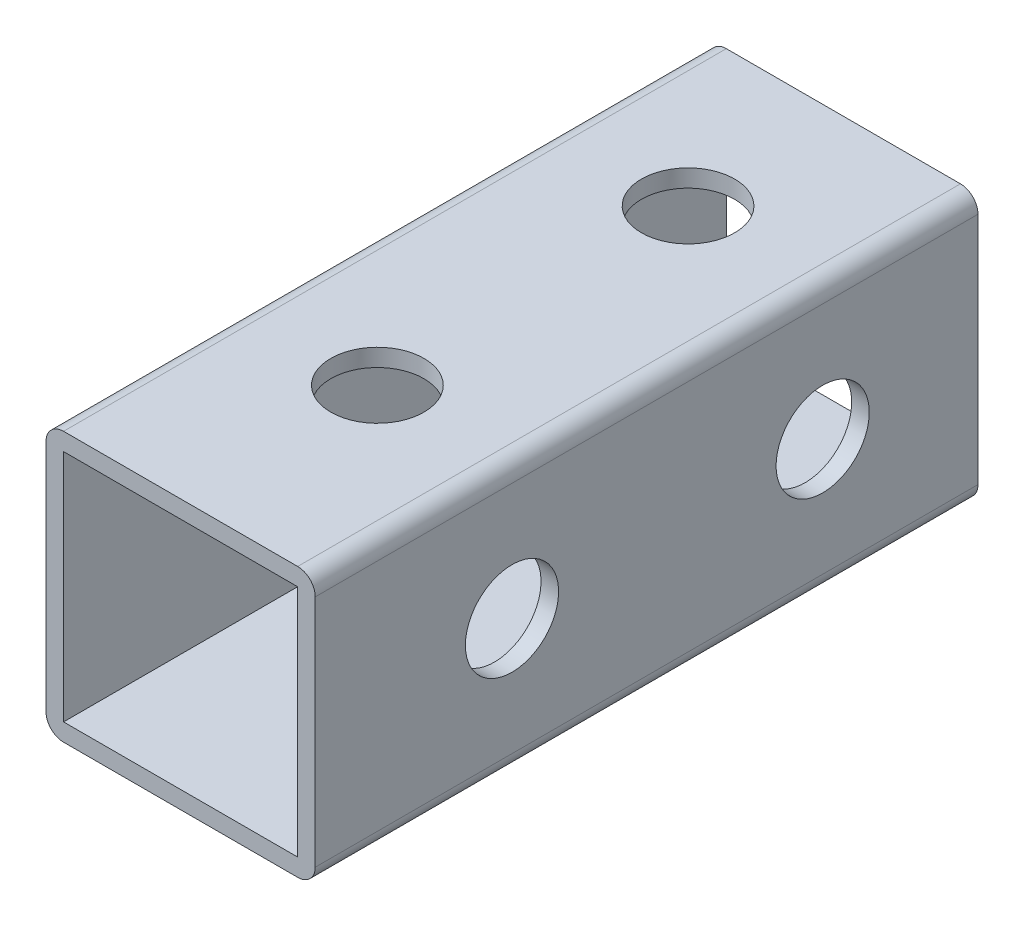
ISO-10303-21;
HEADER;
FILE_DESCRIPTION(('STEP AP214'),'2;1');
FILE_NAME('part.step','',(''),(''),'','','');
FILE_SCHEMA(('AUTOMOTIVE_DESIGN { 1 0 10303 214 1 1 1 1 }'));
ENDSEC;
DATA;
#1=APPLICATION_CONTEXT('core data for automotive mechanical design processes');
#2=APPLICATION_PROTOCOL_DEFINITION('international standard','automotive_design',2000,#1);
#3=PRODUCT_CONTEXT('',#1,'mechanical');
#4=PRODUCT('Part','Part','',(#3));
#5=PRODUCT_RELATED_PRODUCT_CATEGORY('part','',(#4));
#6=PRODUCT_DEFINITION_FORMATION('','',#4);
#7=PRODUCT_DEFINITION_CONTEXT('part definition',#1,'design');
#8=PRODUCT_DEFINITION('design','',#6,#7);
#9=PRODUCT_DEFINITION_SHAPE('','',#8);
#10=(LENGTH_UNIT() NAMED_UNIT(*) SI_UNIT(.MILLI.,.METRE.));
#11=(NAMED_UNIT(*) PLANE_ANGLE_UNIT() SI_UNIT($,.RADIAN.));
#12=(NAMED_UNIT(*) SI_UNIT($,.STERADIAN.) SOLID_ANGLE_UNIT());
#13=UNCERTAINTY_MEASURE_WITH_UNIT(LENGTH_MEASURE(1.E-05),#10,'distance_accuracy_value','');
#14=(GEOMETRIC_REPRESENTATION_CONTEXT(3) GLOBAL_UNCERTAINTY_ASSIGNED_CONTEXT((#13)) GLOBAL_UNIT_ASSIGNED_CONTEXT((#10,
#11,#12)) REPRESENTATION_CONTEXT('',''));
#15=CARTESIAN_POINT('',(0.,0.,0.));
#16=DIRECTION('',(0.,0.,1.));
#17=DIRECTION('',(1.,0.,0.));
#18=AXIS2_PLACEMENT_3D('',#15,#16,#17);
#19=CARTESIAN_POINT('',(17.9451,17.9451,101.6));
#20=DIRECTION('',(0.,0.,-1.));
#21=DIRECTION('',(-1.,0.,0.));
#22=AXIS2_PLACEMENT_3D('',#19,#20,#21);
#23=PLANE('',#22);
#24=CARTESIAN_POINT('',(17.9451,17.9451,101.6));
#25=DIRECTION('',(0.,0.,1.));
#26=DIRECTION('',(-1.,0.,0.));
#27=AXIS2_PLACEMENT_3D('',#24,#25,#26);
#28=CIRCLE('',#27,2.6924);
#29=CARTESIAN_POINT('',(20.6375,17.9451,101.6));
#30=VERTEX_POINT('',#29);
#31=CARTESIAN_POINT('',(17.9451,20.6375,101.6));
#32=VERTEX_POINT('',#31);
#33=EDGE_CURVE('E162',#30,#32,#28,.T.);
#34=ORIENTED_EDGE('',*,*,#33,.T.);
#35=DIRECTION('',(-1.,0.,0.));
#36=VECTOR('',#35,1.);
#37=CARTESIAN_POINT('',(-17.9451,20.6375,101.6));
#38=LINE('',#37,#36);
#39=CARTESIAN_POINT('',(-17.9451,20.6375,101.6));
#40=VERTEX_POINT('',#39);
#41=EDGE_CURVE('E165',#32,#40,#38,.T.);
#42=ORIENTED_EDGE('',*,*,#41,.T.);
#43=CARTESIAN_POINT('',(-17.9451,17.9451,101.6));
#44=DIRECTION('',(0.,0.,1.));
#45=DIRECTION('',(1.,0.,0.));
#46=AXIS2_PLACEMENT_3D('',#43,#44,#45);
#47=CIRCLE('',#46,2.6924);
#48=CARTESIAN_POINT('',(-20.6375,17.9451,101.6));
#49=VERTEX_POINT('',#48);
#50=EDGE_CURVE('E168',#40,#49,#47,.T.);
#51=ORIENTED_EDGE('',*,*,#50,.T.);
#52=DIRECTION('',(0.,-1.,0.));
#53=VECTOR('',#52,1.);
#54=CARTESIAN_POINT('',(-20.6375,17.9451,101.6));
#55=LINE('',#54,#53);
#56=CARTESIAN_POINT('',(-20.6375,-17.9451,101.6));
#57=VERTEX_POINT('',#56);
#58=EDGE_CURVE('E170',#49,#57,#55,.T.);
#59=ORIENTED_EDGE('',*,*,#58,.T.);
#60=CARTESIAN_POINT('',(-17.9451,-17.9451,101.6));
#61=DIRECTION('',(0.,0.,1.));
#62=DIRECTION('',(-1.,0.,0.));
#63=AXIS2_PLACEMENT_3D('',#60,#61,#62);
#64=CIRCLE('',#63,2.6924);
#65=CARTESIAN_POINT('',(-17.9451,-20.6375,101.6));
#66=VERTEX_POINT('',#65);
#67=EDGE_CURVE('E172',#57,#66,#64,.T.);
#68=ORIENTED_EDGE('',*,*,#67,.T.);
#69=DIRECTION('',(1.,0.,0.));
#70=VECTOR('',#69,1.);
#71=CARTESIAN_POINT('',(-17.9451,-20.6375,101.6));
#72=LINE('',#71,#70);
#73=CARTESIAN_POINT('',(17.9451,-20.6375,101.6));
#74=VERTEX_POINT('',#73);
#75=EDGE_CURVE('E174',#66,#74,#72,.T.);
#76=ORIENTED_EDGE('',*,*,#75,.T.);
#77=CARTESIAN_POINT('',(17.9451,-17.9451,101.6));
#78=DIRECTION('',(0.,0.,1.));
#79=DIRECTION('',(1.,0.,0.));
#80=AXIS2_PLACEMENT_3D('',#77,#78,#79);
#81=CIRCLE('',#80,2.6924);
#82=CARTESIAN_POINT('',(20.6375,-17.9451,101.6));
#83=VERTEX_POINT('',#82);
#84=EDGE_CURVE('E176',#74,#83,#81,.T.);
#85=ORIENTED_EDGE('',*,*,#84,.T.);
#86=DIRECTION('',(0.,1.,0.));
#87=VECTOR('',#86,1.);
#88=CARTESIAN_POINT('',(20.6375,-17.9451,101.6));
#89=LINE('',#88,#87);
#90=EDGE_CURVE('E178',#83,#30,#89,.T.);
#91=ORIENTED_EDGE('',*,*,#90,.T.);
#92=EDGE_LOOP('',(#34,#42,#51,#59,#68,#76,#85,#91));
#93=FACE_BOUND('',#92,.T.);
#94=DIRECTION('',(0.,1.,0.));
#95=VECTOR('',#94,1.);
#96=CARTESIAN_POINT('',(17.9451,-17.9451,101.6));
#97=LINE('',#96,#95);
#98=CARTESIAN_POINT('',(17.9451,-17.9451,101.6));
#99=VERTEX_POINT('',#98);
#100=CARTESIAN_POINT('',(17.9451,17.9451,101.6));
#101=VERTEX_POINT('',#100);
#102=EDGE_CURVE('E124',#99,#101,#97,.T.);
#103=ORIENTED_EDGE('',*,*,#102,.F.);
#104=DIRECTION('',(1.,0.,0.));
#105=VECTOR('',#104,1.);
#106=CARTESIAN_POINT('',(-17.9451,-17.9451,101.6));
#107=LINE('',#106,#105);
#108=CARTESIAN_POINT('',(-17.9451,-17.9451,101.6));
#109=VERTEX_POINT('',#108);
#110=EDGE_CURVE('E146',#109,#99,#107,.T.);
#111=ORIENTED_EDGE('',*,*,#110,.F.);
#112=DIRECTION('',(0.,-1.,0.));
#113=VECTOR('',#112,1.);
#114=CARTESIAN_POINT('',(-17.9451,17.9451,101.6));
#115=LINE('',#114,#113);
#116=CARTESIAN_POINT('',(-17.9451,17.9451,101.6));
#117=VERTEX_POINT('',#116);
#118=EDGE_CURVE('E144',#117,#109,#115,.T.);
#119=ORIENTED_EDGE('',*,*,#118,.F.);
#120=DIRECTION('',(-1.,0.,0.));
#121=VECTOR('',#120,1.);
#122=CARTESIAN_POINT('',(-17.9451,17.9451,101.6));
#123=LINE('',#122,#121);
#124=EDGE_CURVE('E132',#101,#117,#123,.T.);
#125=ORIENTED_EDGE('',*,*,#124,.F.);
#126=EDGE_LOOP('',(#103,#111,#119,#125));
#127=FACE_BOUND('',#126,.T.);
#128=ADVANCED_FACE('F33',(#93,#127),#23,.F.);
#129=CARTESIAN_POINT('',(17.9451,17.9451,0.));
#130=DIRECTION('',(0.,0.,-1.));
#131=DIRECTION('',(-1.,0.,0.));
#132=AXIS2_PLACEMENT_3D('',#129,#130,#131);
#133=PLANE('',#132);
#134=CARTESIAN_POINT('',(17.9451,17.9451,0.));
#135=DIRECTION('',(0.,0.,1.));
#136=DIRECTION('',(-1.,0.,0.));
#137=AXIS2_PLACEMENT_3D('',#134,#135,#136);
#138=CIRCLE('',#137,2.6924);
#139=CARTESIAN_POINT('',(20.6375,17.9451,0.));
#140=VERTEX_POINT('',#139);
#141=CARTESIAN_POINT('',(17.9451,20.6375,0.));
#142=VERTEX_POINT('',#141);
#143=EDGE_CURVE('E140',#140,#142,#138,.T.);
#144=ORIENTED_EDGE('',*,*,#143,.F.);
#145=DIRECTION('',(0.,1.,0.));
#146=VECTOR('',#145,1.);
#147=CARTESIAN_POINT('',(20.6375,-17.9451,0.));
#148=LINE('',#147,#146);
#149=CARTESIAN_POINT('',(20.6375,-17.9451,0.));
#150=VERTEX_POINT('',#149);
#151=EDGE_CURVE('E166',#150,#140,#148,.T.);
#152=ORIENTED_EDGE('',*,*,#151,.F.);
#153=CARTESIAN_POINT('',(17.9451,-17.9451,0.));
#154=DIRECTION('',(0.,0.,1.));
#155=DIRECTION('',(1.,0.,0.));
#156=AXIS2_PLACEMENT_3D('',#153,#154,#155);
#157=CIRCLE('',#156,2.6924);
#158=CARTESIAN_POINT('',(17.9451,-20.6375,0.));
#159=VERTEX_POINT('',#158);
#160=EDGE_CURVE('E193',#159,#150,#157,.T.);
#161=ORIENTED_EDGE('',*,*,#160,.F.);
#162=DIRECTION('',(1.,0.,0.));
#163=VECTOR('',#162,1.);
#164=CARTESIAN_POINT('',(-17.9451,-20.6375,0.));
#165=LINE('',#164,#163);
#166=CARTESIAN_POINT('',(-17.9451,-20.6375,0.));
#167=VERTEX_POINT('',#166);
#168=EDGE_CURVE('E191',#167,#159,#165,.T.);
#169=ORIENTED_EDGE('',*,*,#168,.F.);
#170=CARTESIAN_POINT('',(-17.9451,-17.9451,0.));
#171=DIRECTION('',(0.,0.,1.));
#172=DIRECTION('',(-1.,0.,0.));
#173=AXIS2_PLACEMENT_3D('',#170,#171,#172);
#174=CIRCLE('',#173,2.6924);
#175=CARTESIAN_POINT('',(-20.6375,-17.9451,0.));
#176=VERTEX_POINT('',#175);
#177=EDGE_CURVE('E189',#176,#167,#174,.T.);
#178=ORIENTED_EDGE('',*,*,#177,.F.);
#179=DIRECTION('',(0.,-1.,0.));
#180=VECTOR('',#179,1.);
#181=CARTESIAN_POINT('',(-20.6375,17.9451,0.));
#182=LINE('',#181,#180);
#183=CARTESIAN_POINT('',(-20.6375,17.9451,0.));
#184=VERTEX_POINT('',#183);
#185=EDGE_CURVE('E187',#184,#176,#182,.T.);
#186=ORIENTED_EDGE('',*,*,#185,.F.);
#187=CARTESIAN_POINT('',(-17.9451,17.9451,0.));
#188=DIRECTION('',(0.,0.,1.));
#189=DIRECTION('',(1.,0.,0.));
#190=AXIS2_PLACEMENT_3D('',#187,#188,#189);
#191=CIRCLE('',#190,2.6924);
#192=CARTESIAN_POINT('',(-17.9451,20.6375,0.));
#193=VERTEX_POINT('',#192);
#194=EDGE_CURVE('E185',#193,#184,#191,.T.);
#195=ORIENTED_EDGE('',*,*,#194,.F.);
#196=DIRECTION('',(-1.,0.,0.));
#197=VECTOR('',#196,1.);
#198=CARTESIAN_POINT('',(-17.9451,20.6375,0.));
#199=LINE('',#198,#197);
#200=EDGE_CURVE('E183',#142,#193,#199,.T.);
#201=ORIENTED_EDGE('',*,*,#200,.F.);
#202=EDGE_LOOP('',(#144,#152,#161,#169,#178,#186,#195,#201));
#203=FACE_BOUND('',#202,.T.);
#204=DIRECTION('',(1.,0.,0.));
#205=VECTOR('',#204,1.);
#206=CARTESIAN_POINT('',(-17.9451,-17.9451,0.));
#207=LINE('',#206,#205);
#208=CARTESIAN_POINT('',(-17.9451,-17.9451,0.));
#209=VERTEX_POINT('',#208);
#210=CARTESIAN_POINT('',(17.9451,-17.9451,0.));
#211=VERTEX_POINT('',#210);
#212=EDGE_CURVE('E133',#209,#211,#207,.T.);
#213=ORIENTED_EDGE('',*,*,#212,.T.);
#214=DIRECTION('',(0.,1.,0.));
#215=VECTOR('',#214,1.);
#216=CARTESIAN_POINT('',(17.9451,-17.9451,0.));
#217=LINE('',#216,#215);
#218=CARTESIAN_POINT('',(17.9451,17.9451,0.));
#219=VERTEX_POINT('',#218);
#220=EDGE_CURVE('E58',#211,#219,#217,.T.);
#221=ORIENTED_EDGE('',*,*,#220,.T.);
#222=DIRECTION('',(-1.,0.,0.));
#223=VECTOR('',#222,1.);
#224=CARTESIAN_POINT('',(-17.9451,17.9451,0.));
#225=LINE('',#224,#223);
#226=CARTESIAN_POINT('',(-17.9451,17.9451,0.));
#227=VERTEX_POINT('',#226);
#228=EDGE_CURVE('E139',#219,#227,#225,.T.);
#229=ORIENTED_EDGE('',*,*,#228,.T.);
#230=DIRECTION('',(0.,-1.,0.));
#231=VECTOR('',#230,1.);
#232=CARTESIAN_POINT('',(-17.9451,17.9451,0.));
#233=LINE('',#232,#231);
#234=EDGE_CURVE('E154',#227,#209,#233,.T.);
#235=ORIENTED_EDGE('',*,*,#234,.T.);
#236=EDGE_LOOP('',(#213,#221,#229,#235));
#237=FACE_BOUND('',#236,.T.);
#238=ADVANCED_FACE('F282',(#203,#237),#133,.T.);
#239=CARTESIAN_POINT('',(17.9451,17.9451,101.6));
#240=DIRECTION('',(0.,0.,-1.));
#241=DIRECTION('',(-1.,0.,0.));
#242=AXIS2_PLACEMENT_3D('',#239,#240,#241);
#243=CYLINDRICAL_SURFACE('',#242,2.6924);
#244=ORIENTED_EDGE('',*,*,#143,.T.);
#245=DIRECTION('',(0.,0.,-1.));
#246=VECTOR('',#245,1.);
#247=CARTESIAN_POINT('',(17.9451,20.6375,101.6));
#248=LINE('',#247,#246);
#249=EDGE_CURVE('E11',#32,#142,#248,.T.);
#250=ORIENTED_EDGE('',*,*,#249,.F.);
#251=ORIENTED_EDGE('',*,*,#33,.F.);
#252=DIRECTION('',(0.,0.,-1.));
#253=VECTOR('',#252,1.);
#254=CARTESIAN_POINT('',(20.6375,17.9451,101.6));
#255=LINE('',#254,#253);
#256=EDGE_CURVE('E180',#30,#140,#255,.T.);
#257=ORIENTED_EDGE('',*,*,#256,.T.);
#258=EDGE_LOOP('',(#244,#250,#251,#257));
#259=FACE_BOUND('',#258,.T.);
#260=ADVANCED_FACE('F35',(#259),#243,.T.);
#261=CARTESIAN_POINT('',(-17.9451,20.6375,101.6));
#262=DIRECTION('',(0.,-1.,0.));
#263=DIRECTION('',(0.,0.,-1.));
#264=AXIS2_PLACEMENT_3D('',#261,#262,#263);
#265=PLANE('',#264);
#266=CARTESIAN_POINT('',(0.,20.6375,71.4375));
#267=DIRECTION('',(0.,1.,0.));
#268=DIRECTION('',(0.,0.,1.));
#269=AXIS2_PLACEMENT_3D('',#266,#267,#268);
#270=CIRCLE('',#269,7.14375);
#271=CARTESIAN_POINT('',(0.,20.6375,78.58125));
#272=VERTEX_POINT('',#271);
#273=EDGE_CURVE('E234',#272,#272,#270,.T.);
#274=ORIENTED_EDGE('',*,*,#273,.F.);
#275=EDGE_LOOP('',(#274));
#276=FACE_BOUND('',#275,.T.);
#277=CARTESIAN_POINT('',(0.,20.6375,23.8125));
#278=DIRECTION('',(0.,1.,0.));
#279=DIRECTION('',(0.,0.,1.));
#280=AXIS2_PLACEMENT_3D('',#277,#278,#279);
#281=CIRCLE('',#280,7.14375);
#282=CARTESIAN_POINT('',(0.,20.6375,30.95625));
#283=VERTEX_POINT('',#282);
#284=EDGE_CURVE('E256',#283,#283,#281,.T.);
#285=ORIENTED_EDGE('',*,*,#284,.F.);
#286=EDGE_LOOP('',(#285));
#287=FACE_BOUND('',#286,.T.);
#288=ORIENTED_EDGE('',*,*,#200,.T.);
#289=DIRECTION('',(0.,0.,-1.));
#290=VECTOR('',#289,1.);
#291=CARTESIAN_POINT('',(-17.9451,20.6375,101.6));
#292=LINE('',#291,#290);
#293=EDGE_CURVE('E42',#40,#193,#292,.T.);
#294=ORIENTED_EDGE('',*,*,#293,.F.);
#295=ORIENTED_EDGE('',*,*,#41,.F.);
#296=ORIENTED_EDGE('',*,*,#249,.T.);
#297=EDGE_LOOP('',(#288,#294,#295,#296));
#298=FACE_BOUND('',#297,.T.);
#299=ADVANCED_FACE('F311',(#276,#287,#298),#265,.F.);
#300=CARTESIAN_POINT('',(-17.9451,17.9451,101.6));
#301=DIRECTION('',(0.,0.,-1.));
#302=DIRECTION('',(-1.,0.,0.));
#303=AXIS2_PLACEMENT_3D('',#300,#301,#302);
#304=CYLINDRICAL_SURFACE('',#303,2.6924);
#305=ORIENTED_EDGE('',*,*,#194,.T.);
#306=DIRECTION('',(0.,0.,-1.));
#307=VECTOR('',#306,1.);
#308=CARTESIAN_POINT('',(-20.6375,17.9451,101.6));
#309=LINE('',#308,#307);
#310=EDGE_CURVE('E210',#49,#184,#309,.T.);
#311=ORIENTED_EDGE('',*,*,#310,.F.);
#312=ORIENTED_EDGE('',*,*,#50,.F.);
#313=ORIENTED_EDGE('',*,*,#293,.T.);
#314=EDGE_LOOP('',(#305,#311,#312,#313));
#315=FACE_BOUND('',#314,.T.);
#316=ADVANCED_FACE('F308',(#315),#304,.T.);
#317=CARTESIAN_POINT('',(-20.6375,17.9451,101.6));
#318=DIRECTION('',(1.,0.,0.));
#319=DIRECTION('',(0.,0.,-1.));
#320=AXIS2_PLACEMENT_3D('',#317,#318,#319);
#321=PLANE('',#320);
#322=CARTESIAN_POINT('',(-20.6375,0.,71.4375));
#323=DIRECTION('',(-1.,0.,0.));
#324=DIRECTION('',(0.,0.,1.));
#325=AXIS2_PLACEMENT_3D('',#322,#323,#324);
#326=CIRCLE('',#325,7.14375);
#327=CARTESIAN_POINT('',(-20.6375,0.,78.58125));
#328=VERTEX_POINT('',#327);
#329=EDGE_CURVE('E236',#328,#328,#326,.T.);
#330=ORIENTED_EDGE('',*,*,#329,.F.);
#331=EDGE_LOOP('',(#330));
#332=FACE_BOUND('',#331,.T.);
#333=CARTESIAN_POINT('',(-20.6375,0.,23.8125));
#334=DIRECTION('',(-1.,0.,0.));
#335=DIRECTION('',(0.,0.,1.));
#336=AXIS2_PLACEMENT_3D('',#333,#334,#335);
#337=CIRCLE('',#336,7.14375);
#338=CARTESIAN_POINT('',(-20.6375,0.,30.95625));
#339=VERTEX_POINT('',#338);
#340=EDGE_CURVE('E249',#339,#339,#337,.T.);
#341=ORIENTED_EDGE('',*,*,#340,.F.);
#342=EDGE_LOOP('',(#341));
#343=FACE_BOUND('',#342,.T.);
#344=ORIENTED_EDGE('',*,*,#185,.T.);
#345=DIRECTION('',(0.,0.,-1.));
#346=VECTOR('',#345,1.);
#347=CARTESIAN_POINT('',(-20.6375,-17.9451,101.6));
#348=LINE('',#347,#346);
#349=EDGE_CURVE('E207',#57,#176,#348,.T.);
#350=ORIENTED_EDGE('',*,*,#349,.F.);
#351=ORIENTED_EDGE('',*,*,#58,.F.);
#352=ORIENTED_EDGE('',*,*,#310,.T.);
#353=EDGE_LOOP('',(#344,#350,#351,#352));
#354=FACE_BOUND('',#353,.T.);
#355=ADVANCED_FACE('F304',(#332,#343,#354),#321,.F.);
#356=CARTESIAN_POINT('',(-17.9451,-17.9451,101.6));
#357=DIRECTION('',(0.,0.,-1.));
#358=DIRECTION('',(-1.,0.,0.));
#359=AXIS2_PLACEMENT_3D('',#356,#357,#358);
#360=CYLINDRICAL_SURFACE('',#359,2.6924);
#361=ORIENTED_EDGE('',*,*,#177,.T.);
#362=DIRECTION('',(0.,0.,-1.));
#363=VECTOR('',#362,1.);
#364=CARTESIAN_POINT('',(-17.9451,-20.6375,101.6));
#365=LINE('',#364,#363);
#366=EDGE_CURVE('E204',#66,#167,#365,.T.);
#367=ORIENTED_EDGE('',*,*,#366,.F.);
#368=ORIENTED_EDGE('',*,*,#67,.F.);
#369=ORIENTED_EDGE('',*,*,#349,.T.);
#370=EDGE_LOOP('',(#361,#367,#368,#369));
#371=FACE_BOUND('',#370,.T.);
#372=ADVANCED_FACE('F300',(#371),#360,.T.);
#373=CARTESIAN_POINT('',(-17.9451,-20.6375,101.6));
#374=DIRECTION('',(0.,1.,0.));
#375=DIRECTION('',(0.,0.,1.));
#376=AXIS2_PLACEMENT_3D('',#373,#374,#375);
#377=PLANE('',#376);
#378=CARTESIAN_POINT('',(0.,-20.6375,71.4375));
#379=DIRECTION('',(0.,1.,0.));
#380=DIRECTION('',(0.,0.,1.));
#381=AXIS2_PLACEMENT_3D('',#378,#379,#380);
#382=CIRCLE('',#381,7.14375);
#383=CARTESIAN_POINT('',(0.,-20.6375,78.58125));
#384=VERTEX_POINT('',#383);
#385=EDGE_CURVE('E227',#384,#384,#382,.T.);
#386=ORIENTED_EDGE('',*,*,#385,.T.);
#387=EDGE_LOOP('',(#386));
#388=FACE_BOUND('',#387,.T.);
#389=CARTESIAN_POINT('',(0.,-20.6375,23.8125));
#390=DIRECTION('',(0.,1.,0.));
#391=DIRECTION('',(0.,0.,1.));
#392=AXIS2_PLACEMENT_3D('',#389,#390,#391);
#393=CIRCLE('',#392,7.14375);
#394=CARTESIAN_POINT('',(0.,-20.6375,30.95625));
#395=VERTEX_POINT('',#394);
#396=EDGE_CURVE('E218',#395,#395,#393,.T.);
#397=ORIENTED_EDGE('',*,*,#396,.T.);
#398=EDGE_LOOP('',(#397));
#399=FACE_BOUND('',#398,.T.);
#400=ORIENTED_EDGE('',*,*,#168,.T.);
#401=DIRECTION('',(0.,0.,-1.));
#402=VECTOR('',#401,1.);
#403=CARTESIAN_POINT('',(17.9451,-20.6375,101.6));
#404=LINE('',#403,#402);
#405=EDGE_CURVE('E201',#74,#159,#404,.T.);
#406=ORIENTED_EDGE('',*,*,#405,.F.);
#407=ORIENTED_EDGE('',*,*,#75,.F.);
#408=ORIENTED_EDGE('',*,*,#366,.T.);
#409=EDGE_LOOP('',(#400,#406,#407,#408));
#410=FACE_BOUND('',#409,.T.);
#411=ADVANCED_FACE('F296',(#388,#399,#410),#377,.F.);
#412=CARTESIAN_POINT('',(17.9451,-17.9451,101.6));
#413=DIRECTION('',(0.,0.,-1.));
#414=DIRECTION('',(-1.,0.,0.));
#415=AXIS2_PLACEMENT_3D('',#412,#413,#414);
#416=CYLINDRICAL_SURFACE('',#415,2.6924);
#417=ORIENTED_EDGE('',*,*,#160,.T.);
#418=DIRECTION('',(0.,0.,-1.));
#419=VECTOR('',#418,1.);
#420=CARTESIAN_POINT('',(20.6375,-17.9451,101.6));
#421=LINE('',#420,#419);
#422=EDGE_CURVE('E198',#83,#150,#421,.T.);
#423=ORIENTED_EDGE('',*,*,#422,.F.);
#424=ORIENTED_EDGE('',*,*,#84,.F.);
#425=ORIENTED_EDGE('',*,*,#405,.T.);
#426=EDGE_LOOP('',(#417,#423,#424,#425));
#427=FACE_BOUND('',#426,.T.);
#428=ADVANCED_FACE('F293',(#427),#416,.T.);
#429=CARTESIAN_POINT('',(20.6375,-17.9451,101.6));
#430=DIRECTION('',(-1.,0.,0.));
#431=DIRECTION('',(0.,0.,1.));
#432=AXIS2_PLACEMENT_3D('',#429,#430,#431);
#433=PLANE('',#432);
#434=CARTESIAN_POINT('',(20.6375000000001,0.,71.4375));
#435=DIRECTION('',(-1.,0.,0.));
#436=DIRECTION('',(0.,0.,1.));
#437=AXIS2_PLACEMENT_3D('',#434,#435,#436);
#438=CIRCLE('',#437,7.14375);
#439=CARTESIAN_POINT('',(20.6375000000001,0.,78.58125));
#440=VERTEX_POINT('',#439);
#441=EDGE_CURVE('E230',#440,#440,#438,.T.);
#442=ORIENTED_EDGE('',*,*,#441,.T.);
#443=EDGE_LOOP('',(#442));
#444=FACE_BOUND('',#443,.T.);
#445=CARTESIAN_POINT('',(20.6375000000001,0.,23.8125));
#446=DIRECTION('',(-1.,0.,0.));
#447=DIRECTION('',(0.,0.,1.));
#448=AXIS2_PLACEMENT_3D('',#445,#446,#447);
#449=CIRCLE('',#448,7.14375);
#450=CARTESIAN_POINT('',(20.6375000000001,0.,30.95625));
#451=VERTEX_POINT('',#450);
#452=EDGE_CURVE('E223',#451,#451,#449,.T.);
#453=ORIENTED_EDGE('',*,*,#452,.T.);
#454=EDGE_LOOP('',(#453));
#455=FACE_BOUND('',#454,.T.);
#456=ORIENTED_EDGE('',*,*,#151,.T.);
#457=ORIENTED_EDGE('',*,*,#256,.F.);
#458=ORIENTED_EDGE('',*,*,#90,.F.);
#459=ORIENTED_EDGE('',*,*,#422,.T.);
#460=EDGE_LOOP('',(#456,#457,#458,#459));
#461=FACE_BOUND('',#460,.T.);
#462=ADVANCED_FACE('F277',(#444,#455,#461),#433,.F.);
#463=CARTESIAN_POINT('',(17.9451,-17.9451,101.6));
#464=DIRECTION('',(-1.,0.,0.));
#465=DIRECTION('',(0.,0.,1.));
#466=AXIS2_PLACEMENT_3D('',#463,#464,#465);
#467=PLANE('',#466);
#468=CARTESIAN_POINT('',(17.9451,0.,71.4375));
#469=DIRECTION('',(-1.,0.,0.));
#470=DIRECTION('',(0.,0.,1.));
#471=AXIS2_PLACEMENT_3D('',#468,#469,#470);
#472=CIRCLE('',#471,7.14375);
#473=CARTESIAN_POINT('',(17.9451,0.,78.58125));
#474=VERTEX_POINT('',#473);
#475=EDGE_CURVE('E37',#474,#474,#472,.T.);
#476=ORIENTED_EDGE('',*,*,#475,.F.);
#477=EDGE_LOOP('',(#476));
#478=FACE_BOUND('',#477,.T.);
#479=CARTESIAN_POINT('',(17.9451,0.,23.8125));
#480=DIRECTION('',(-1.,0.,0.));
#481=DIRECTION('',(0.,0.,1.));
#482=AXIS2_PLACEMENT_3D('',#479,#480,#481);
#483=CIRCLE('',#482,7.14375);
#484=CARTESIAN_POINT('',(17.9451,0.,30.95625));
#485=VERTEX_POINT('',#484);
#486=EDGE_CURVE('E222',#485,#485,#483,.T.);
#487=ORIENTED_EDGE('',*,*,#486,.F.);
#488=EDGE_LOOP('',(#487));
#489=FACE_BOUND('',#488,.T.);
#490=ORIENTED_EDGE('',*,*,#220,.F.);
#491=DIRECTION('',(0.,0.,-1.));
#492=VECTOR('',#491,1.);
#493=CARTESIAN_POINT('',(17.9451,-17.9451,101.6));
#494=LINE('',#493,#492);
#495=EDGE_CURVE('E128',#99,#211,#494,.T.);
#496=ORIENTED_EDGE('',*,*,#495,.F.);
#497=ORIENTED_EDGE('',*,*,#102,.T.);
#498=DIRECTION('',(0.,0.,-1.));
#499=VECTOR('',#498,1.);
#500=CARTESIAN_POINT('',(17.9451,17.9451,101.6));
#501=LINE('',#500,#499);
#502=EDGE_CURVE('E127',#101,#219,#501,.T.);
#503=ORIENTED_EDGE('',*,*,#502,.T.);
#504=EDGE_LOOP('',(#490,#496,#497,#503));
#505=FACE_BOUND('',#504,.T.);
#506=ADVANCED_FACE('F126',(#478,#489,#505),#467,.T.);
#507=CARTESIAN_POINT('',(-17.9451,17.9451,101.6));
#508=DIRECTION('',(0.,-1.,0.));
#509=DIRECTION('',(0.,0.,-1.));
#510=AXIS2_PLACEMENT_3D('',#507,#508,#509);
#511=PLANE('',#510);
#512=CARTESIAN_POINT('',(0.,17.9451,71.4375));
#513=DIRECTION('',(0.,-1.,0.));
#514=DIRECTION('',(0.,0.,-1.));
#515=AXIS2_PLACEMENT_3D('',#512,#513,#514);
#516=CIRCLE('',#515,7.14375);
#517=CARTESIAN_POINT('',(0.,17.9451,64.29375));
#518=VERTEX_POINT('',#517);
#519=EDGE_CURVE('E226',#518,#518,#516,.T.);
#520=ORIENTED_EDGE('',*,*,#519,.F.);
#521=EDGE_LOOP('',(#520));
#522=FACE_BOUND('',#521,.T.);
#523=CARTESIAN_POINT('',(0.,17.9451,23.8125));
#524=DIRECTION('',(0.,-1.,0.));
#525=DIRECTION('',(0.,0.,-1.));
#526=AXIS2_PLACEMENT_3D('',#523,#524,#525);
#527=CIRCLE('',#526,7.14375);
#528=CARTESIAN_POINT('',(0.,17.9451,16.66875));
#529=VERTEX_POINT('',#528);
#530=EDGE_CURVE('E152',#529,#529,#527,.T.);
#531=ORIENTED_EDGE('',*,*,#530,.F.);
#532=EDGE_LOOP('',(#531));
#533=FACE_BOUND('',#532,.T.);
#534=ORIENTED_EDGE('',*,*,#228,.F.);
#535=ORIENTED_EDGE('',*,*,#502,.F.);
#536=ORIENTED_EDGE('',*,*,#124,.T.);
#537=DIRECTION('',(0.,0.,-1.));
#538=VECTOR('',#537,1.);
#539=CARTESIAN_POINT('',(-17.9451,17.9451,101.6));
#540=LINE('',#539,#538);
#541=EDGE_CURVE('E141',#117,#227,#540,.T.);
#542=ORIENTED_EDGE('',*,*,#541,.T.);
#543=EDGE_LOOP('',(#534,#535,#536,#542));
#544=FACE_BOUND('',#543,.T.);
#545=ADVANCED_FACE('F136',(#522,#533,#544),#511,.T.);
#546=CARTESIAN_POINT('',(-17.9451,17.9451,101.6));
#547=DIRECTION('',(1.,0.,0.));
#548=DIRECTION('',(0.,0.,-1.));
#549=AXIS2_PLACEMENT_3D('',#546,#547,#548);
#550=PLANE('',#549);
#551=CARTESIAN_POINT('',(-17.9451,0.,71.4375));
#552=DIRECTION('',(1.,0.,0.));
#553=DIRECTION('',(0.,0.,-1.));
#554=AXIS2_PLACEMENT_3D('',#551,#552,#553);
#555=CIRCLE('',#554,7.14375);
#556=CARTESIAN_POINT('',(-17.9451,0.,64.29375));
#557=VERTEX_POINT('',#556);
#558=EDGE_CURVE('E228',#557,#557,#555,.T.);
#559=ORIENTED_EDGE('',*,*,#558,.F.);
#560=EDGE_LOOP('',(#559));
#561=FACE_BOUND('',#560,.T.);
#562=CARTESIAN_POINT('',(-17.9451,0.,23.8125));
#563=DIRECTION('',(1.,0.,0.));
#564=DIRECTION('',(0.,0.,-1.));
#565=AXIS2_PLACEMENT_3D('',#562,#563,#564);
#566=CIRCLE('',#565,7.14375);
#567=CARTESIAN_POINT('',(-17.9451,0.,16.66875));
#568=VERTEX_POINT('',#567);
#569=EDGE_CURVE('E219',#568,#568,#566,.T.);
#570=ORIENTED_EDGE('',*,*,#569,.F.);
#571=EDGE_LOOP('',(#570));
#572=FACE_BOUND('',#571,.T.);
#573=ORIENTED_EDGE('',*,*,#234,.F.);
#574=ORIENTED_EDGE('',*,*,#541,.F.);
#575=ORIENTED_EDGE('',*,*,#118,.T.);
#576=DIRECTION('',(0.,0.,-1.));
#577=VECTOR('',#576,1.);
#578=CARTESIAN_POINT('',(-17.9451,-17.9451,101.6));
#579=LINE('',#578,#577);
#580=EDGE_CURVE('E50',#109,#209,#579,.T.);
#581=ORIENTED_EDGE('',*,*,#580,.T.);
#582=EDGE_LOOP('',(#573,#574,#575,#581));
#583=FACE_BOUND('',#582,.T.);
#584=ADVANCED_FACE('F267',(#561,#572,#583),#550,.T.);
#585=CARTESIAN_POINT('',(-17.9451,-17.9451,101.6));
#586=DIRECTION('',(0.,1.,0.));
#587=DIRECTION('',(0.,0.,1.));
#588=AXIS2_PLACEMENT_3D('',#585,#586,#587);
#589=PLANE('',#588);
#590=CARTESIAN_POINT('',(0.,-17.9451,71.4375));
#591=DIRECTION('',(0.,1.,0.));
#592=DIRECTION('',(0.,0.,1.));
#593=AXIS2_PLACEMENT_3D('',#590,#591,#592);
#594=CIRCLE('',#593,7.14375);
#595=CARTESIAN_POINT('',(0.,-17.9451,78.58125));
#596=VERTEX_POINT('',#595);
#597=EDGE_CURVE('E224',#596,#596,#594,.T.);
#598=ORIENTED_EDGE('',*,*,#597,.F.);
#599=EDGE_LOOP('',(#598));
#600=FACE_BOUND('',#599,.T.);
#601=CARTESIAN_POINT('',(0.,-17.9451,23.8125));
#602=DIRECTION('',(0.,1.,0.));
#603=DIRECTION('',(0.,0.,1.));
#604=AXIS2_PLACEMENT_3D('',#601,#602,#603);
#605=CIRCLE('',#604,7.14375);
#606=CARTESIAN_POINT('',(0.,-17.9451,30.95625));
#607=VERTEX_POINT('',#606);
#608=EDGE_CURVE('E215',#607,#607,#605,.T.);
#609=ORIENTED_EDGE('',*,*,#608,.F.);
#610=EDGE_LOOP('',(#609));
#611=FACE_BOUND('',#610,.T.);
#612=ORIENTED_EDGE('',*,*,#212,.F.);
#613=ORIENTED_EDGE('',*,*,#580,.F.);
#614=ORIENTED_EDGE('',*,*,#110,.T.);
#615=ORIENTED_EDGE('',*,*,#495,.T.);
#616=EDGE_LOOP('',(#612,#613,#614,#615));
#617=FACE_BOUND('',#616,.T.);
#618=ADVANCED_FACE('F274',(#600,#611,#617),#589,.T.);
#619=CARTESIAN_POINT('',(0.,-20.6375,23.8125));
#620=DIRECTION('',(0.,1.,0.));
#621=DIRECTION('',(0.,0.,1.));
#622=AXIS2_PLACEMENT_3D('',#619,#620,#621);
#623=CYLINDRICAL_SURFACE('',#622,7.14375);
#624=ORIENTED_EDGE('',*,*,#608,.T.);
#625=EDGE_LOOP('',(#624));
#626=FACE_BOUND('',#625,.T.);
#627=ORIENTED_EDGE('',*,*,#396,.F.);
#628=EDGE_LOOP('',(#627));
#629=FACE_BOUND('',#628,.T.);
#630=ADVANCED_FACE('F351',(#626,#629),#623,.F.);
#631=ORIENTED_EDGE('',*,*,#530,.T.);
#632=EDGE_LOOP('',(#631));
#633=FACE_BOUND('',#632,.T.);
#634=ORIENTED_EDGE('',*,*,#284,.T.);
#635=EDGE_LOOP('',(#634));
#636=FACE_BOUND('',#635,.T.);
#637=ADVANCED_FACE('F263',(#633,#636),#623,.F.);
#638=CARTESIAN_POINT('',(20.6375000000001,0.,23.8125));
#639=DIRECTION('',(-1.,0.,0.));
#640=DIRECTION('',(0.,-1.,0.));
#641=AXIS2_PLACEMENT_3D('',#638,#639,#640);
#642=CYLINDRICAL_SURFACE('',#641,7.14375);
#643=ORIENTED_EDGE('',*,*,#569,.T.);
#644=EDGE_LOOP('',(#643));
#645=FACE_BOUND('',#644,.T.);
#646=ORIENTED_EDGE('',*,*,#340,.T.);
#647=EDGE_LOOP('',(#646));
#648=FACE_BOUND('',#647,.T.);
#649=ADVANCED_FACE('F362',(#645,#648),#642,.F.);
#650=ORIENTED_EDGE('',*,*,#486,.T.);
#651=EDGE_LOOP('',(#650));
#652=FACE_BOUND('',#651,.T.);
#653=ORIENTED_EDGE('',*,*,#452,.F.);
#654=EDGE_LOOP('',(#653));
#655=FACE_BOUND('',#654,.T.);
#656=ADVANCED_FACE('F365',(#652,#655),#642,.F.);
#657=CARTESIAN_POINT('',(0.,-20.6375,71.4375));
#658=DIRECTION('',(0.,1.,0.));
#659=DIRECTION('',(0.,0.,1.));
#660=AXIS2_PLACEMENT_3D('',#657,#658,#659);
#661=CYLINDRICAL_SURFACE('',#660,7.14375);
#662=ORIENTED_EDGE('',*,*,#597,.T.);
#663=EDGE_LOOP('',(#662));
#664=FACE_BOUND('',#663,.T.);
#665=ORIENTED_EDGE('',*,*,#385,.F.);
#666=EDGE_LOOP('',(#665));
#667=FACE_BOUND('',#666,.T.);
#668=ADVANCED_FACE('F367',(#664,#667),#661,.F.);
#669=ORIENTED_EDGE('',*,*,#519,.T.);
#670=EDGE_LOOP('',(#669));
#671=FACE_BOUND('',#670,.T.);
#672=ORIENTED_EDGE('',*,*,#273,.T.);
#673=EDGE_LOOP('',(#672));
#674=FACE_BOUND('',#673,.T.);
#675=ADVANCED_FACE('F370',(#671,#674),#661,.F.);
#676=CARTESIAN_POINT('',(20.6375000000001,0.,71.4375));
#677=DIRECTION('',(-1.,0.,0.));
#678=DIRECTION('',(0.,-1.,0.));
#679=AXIS2_PLACEMENT_3D('',#676,#677,#678);
#680=CYLINDRICAL_SURFACE('',#679,7.14375);
#681=ORIENTED_EDGE('',*,*,#558,.T.);
#682=EDGE_LOOP('',(#681));
#683=FACE_BOUND('',#682,.T.);
#684=ORIENTED_EDGE('',*,*,#329,.T.);
#685=EDGE_LOOP('',(#684));
#686=FACE_BOUND('',#685,.T.);
#687=ADVANCED_FACE('F374',(#683,#686),#680,.F.);
#688=ORIENTED_EDGE('',*,*,#475,.T.);
#689=EDGE_LOOP('',(#688));
#690=FACE_BOUND('',#689,.T.);
#691=ORIENTED_EDGE('',*,*,#441,.F.);
#692=EDGE_LOOP('',(#691));
#693=FACE_BOUND('',#692,.T.);
#694=ADVANCED_FACE('F372',(#690,#693),#680,.F.);
#695=CLOSED_SHELL('',(#128,#238,#260,#299,#316,#355,#372,#411,#428,#462,#506,#545,#584,#618,
#630,#637,#649,#656,#668,#675,#687,#694));
#696=MANIFOLD_SOLID_BREP('B2',#695);
#697=ADVANCED_BREP_SHAPE_REPRESENTATION('',(#18,#696),#14);
#698=SHAPE_DEFINITION_REPRESENTATION(#9,#697);
ENDSEC;
END-ISO-10303-21;
